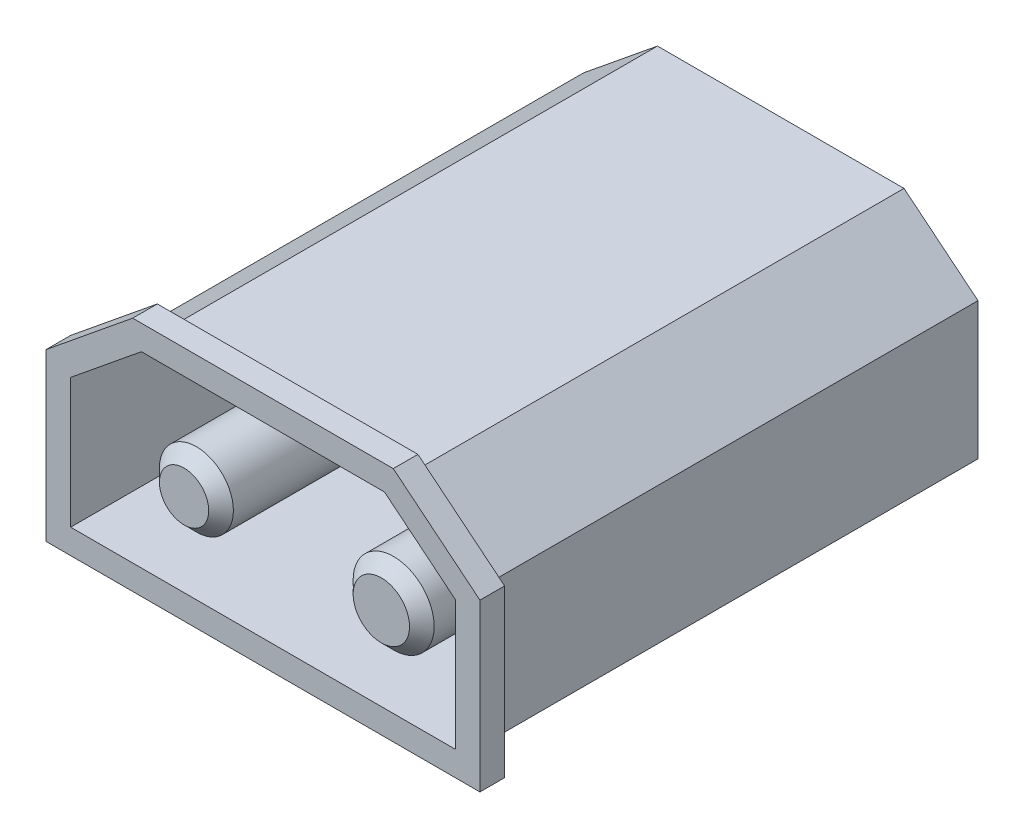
ISO-10303-21;
HEADER;
FILE_DESCRIPTION(('STEP AP214'),'2;1');
FILE_NAME('part.step','',(''),(''),'','','');
FILE_SCHEMA(('AUTOMOTIVE_DESIGN { 1 0 10303 214 1 1 1 1 }'));
ENDSEC;
DATA;
#1=APPLICATION_CONTEXT('core data for automotive mechanical design processes');
#2=APPLICATION_PROTOCOL_DEFINITION('international standard','automotive_design',2000,#1);
#3=PRODUCT_CONTEXT('',#1,'mechanical');
#4=PRODUCT('Part','Part','',(#3));
#5=PRODUCT_RELATED_PRODUCT_CATEGORY('part','',(#4));
#6=PRODUCT_DEFINITION_FORMATION('','',#4);
#7=PRODUCT_DEFINITION_CONTEXT('part definition',#1,'design');
#8=PRODUCT_DEFINITION('design','',#6,#7);
#9=PRODUCT_DEFINITION_SHAPE('','',#8);
#10=(LENGTH_UNIT() NAMED_UNIT(*) SI_UNIT(.MILLI.,.METRE.));
#11=(NAMED_UNIT(*) PLANE_ANGLE_UNIT() SI_UNIT($,.RADIAN.));
#12=(NAMED_UNIT(*) SI_UNIT($,.STERADIAN.) SOLID_ANGLE_UNIT());
#13=UNCERTAINTY_MEASURE_WITH_UNIT(LENGTH_MEASURE(1.E-05),#10,'distance_accuracy_value','');
#14=(GEOMETRIC_REPRESENTATION_CONTEXT(3) GLOBAL_UNCERTAINTY_ASSIGNED_CONTEXT((#13)) GLOBAL_UNIT_ASSIGNED_CONTEXT((#10,
#11,#12)) REPRESENTATION_CONTEXT('',''));
#15=CARTESIAN_POINT('',(0.,0.,0.));
#16=DIRECTION('',(0.,0.,1.));
#17=DIRECTION('',(1.,0.,0.));
#18=AXIS2_PLACEMENT_3D('',#15,#16,#17);
#19=CARTESIAN_POINT('',(-40.,-24.5,-19.8));
#20=DIRECTION('',(0.,0.,-1.));
#21=DIRECTION('',(-1.,0.,0.));
#22=AXIS2_PLACEMENT_3D('',#19,#20,#21);
#23=PLANE('',#22);
#24=CARTESIAN_POINT('',(-36.,-29.7213109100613,-19.8));
#25=DIRECTION('',(0.,0.,-1.));
#26=DIRECTION('',(-1.,0.,0.));
#27=AXIS2_PLACEMENT_3D('',#24,#25,#26);
#28=CIRCLE('',#27,1.5);
#29=CARTESIAN_POINT('',(-37.5,-29.7213109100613,-19.8));
#30=VERTEX_POINT('',#29);
#31=EDGE_CURVE('E313',#30,#30,#28,.F.);
#32=ORIENTED_EDGE('',*,*,#31,.F.);
#33=EDGE_LOOP('',(#32));
#34=FACE_BOUND('',#33,.T.);
#35=DIRECTION('',(0.,1.,0.));
#36=VECTOR('',#35,1.);
#37=CARTESIAN_POINT('',(-39.8,-32.5,-19.8));
#38=LINE('',#37,#36);
#39=CARTESIAN_POINT('',(-39.8,-32.3,-19.8));
#40=VERTEX_POINT('',#39);
#41=CARTESIAN_POINT('',(-39.8,-27.0376899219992,-19.8));
#42=VERTEX_POINT('',#41);
#43=EDGE_CURVE('E243',#40,#42,#38,.T.);
#44=ORIENTED_EDGE('',*,*,#43,.F.);
#45=DIRECTION('',(-1.,0.,0.));
#46=VECTOR('',#45,1.);
#47=CARTESIAN_POINT('',(-24.,-32.3,-19.8));
#48=LINE('',#47,#46);
#49=CARTESIAN_POINT('',(-24.2,-32.3,-19.8));
#50=VERTEX_POINT('',#49);
#51=EDGE_CURVE('E252',#50,#40,#48,.T.);
#52=ORIENTED_EDGE('',*,*,#51,.F.);
#53=DIRECTION('',(0.,-1.,0.));
#54=VECTOR('',#53,1.);
#55=CARTESIAN_POINT('',(-24.2,-26.9426218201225,-19.8));
#56=LINE('',#55,#54);
#57=CARTESIAN_POINT('',(-24.2,-27.0376899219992,-19.8));
#58=VERTEX_POINT('',#57);
#59=EDGE_CURVE('E166',#58,#50,#56,.T.);
#60=ORIENTED_EDGE('',*,*,#59,.F.);
#61=DIRECTION('',(0.77546564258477,-0.631389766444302,0.));
#62=VECTOR('',#61,1.);
#63=CARTESIAN_POINT('',(-27.1262779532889,-24.6550931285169,-19.8));
#64=LINE('',#63,#62);
#65=CARTESIAN_POINT('',(-27.0711238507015,-24.7,-19.8));
#66=VERTEX_POINT('',#65);
#67=EDGE_CURVE('E261',#66,#58,#64,.T.);
#68=ORIENTED_EDGE('',*,*,#67,.F.);
#69=DIRECTION('',(1.,0.,0.));
#70=VECTOR('',#69,1.);
#71=CARTESIAN_POINT('',(-37.,-24.7,-19.8));
#72=LINE('',#71,#70);
#73=CARTESIAN_POINT('',(-36.9288761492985,-24.7,-19.8));
#74=VERTEX_POINT('',#73);
#75=EDGE_CURVE('E257',#74,#66,#72,.T.);
#76=ORIENTED_EDGE('',*,*,#75,.F.);
#77=DIRECTION('',(0.775465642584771,0.631389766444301,0.));
#78=VECTOR('',#77,1.);
#79=CARTESIAN_POINT('',(-39.8737220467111,-27.0977149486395,-19.8));
#80=LINE('',#79,#78);
#81=EDGE_CURVE('E250',#42,#74,#80,.T.);
#82=ORIENTED_EDGE('',*,*,#81,.F.);
#83=EDGE_LOOP('',(#44,#52,#60,#68,#76,#82));
#84=FACE_BOUND('',#83,.T.);
#85=CARTESIAN_POINT('',(-28.,-29.7213109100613,-19.8));
#86=DIRECTION('',(0.,0.,-1.));
#87=DIRECTION('',(-1.,0.,0.));
#88=AXIS2_PLACEMENT_3D('',#85,#86,#87);
#89=CIRCLE('',#88,1.64304810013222);
#90=CARTESIAN_POINT('',(-29.6430481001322,-29.7213109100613,-19.8));
#91=VERTEX_POINT('',#90);
#92=EDGE_CURVE('E316',#91,#91,#89,.F.);
#93=ORIENTED_EDGE('',*,*,#92,.F.);
#94=EDGE_LOOP('',(#93));
#95=FACE_BOUND('',#94,.T.);
#96=ADVANCED_FACE('F30',(#34,#84,#95),#23,.F.);
#97=CARTESIAN_POINT('',(-39.8,-32.5,-20.));
#98=DIRECTION('',(1.,0.,0.));
#99=DIRECTION('',(0.,0.,-1.));
#100=AXIS2_PLACEMENT_3D('',#97,#98,#99);
#101=PLANE('',#100);
#102=DIRECTION('',(0.,0.,1.));
#103=VECTOR('',#102,1.);
#104=CARTESIAN_POINT('',(-39.8,-27.0376899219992,-20.));
#105=LINE('',#104,#103);
#106=CARTESIAN_POINT('',(-39.8,-27.0376899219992,1.));
#107=VERTEX_POINT('',#106);
#108=EDGE_CURVE('E244',#42,#107,#105,.T.);
#109=ORIENTED_EDGE('',*,*,#108,.T.);
#110=DIRECTION('',(0.,1.,0.));
#111=VECTOR('',#110,1.);
#112=CARTESIAN_POINT('',(-39.8,-32.3,1.));
#113=LINE('',#112,#111);
#114=CARTESIAN_POINT('',(-39.8,-32.3,1.));
#115=VERTEX_POINT('',#114);
#116=EDGE_CURVE('E179',#115,#107,#113,.T.);
#117=ORIENTED_EDGE('',*,*,#116,.F.);
#118=DIRECTION('',(0.,0.,1.));
#119=VECTOR('',#118,1.);
#120=CARTESIAN_POINT('',(-39.8,-32.3,-20.));
#121=LINE('',#120,#119);
#122=EDGE_CURVE('E171',#40,#115,#121,.T.);
#123=ORIENTED_EDGE('',*,*,#122,.F.);
#124=ORIENTED_EDGE('',*,*,#43,.T.);
#125=EDGE_LOOP('',(#109,#117,#123,#124));
#126=FACE_BOUND('',#125,.T.);
#127=ADVANCED_FACE('F348',(#126),#101,.T.);
#128=CARTESIAN_POINT('',(-39.8737220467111,-27.0977149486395,-20.));
#129=DIRECTION('',(0.631389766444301,-0.77546564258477,0.));
#130=DIRECTION('',(0.775465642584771,0.631389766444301,0.));
#131=AXIS2_PLACEMENT_3D('',#128,#129,#130);
#132=PLANE('',#131);
#133=DIRECTION('',(0.,0.,1.));
#134=VECTOR('',#133,1.);
#135=CARTESIAN_POINT('',(-36.9288761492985,-24.7,-20.));
#136=LINE('',#135,#134);
#137=CARTESIAN_POINT('',(-36.9288761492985,-24.7,1.));
#138=VERTEX_POINT('',#137);
#139=EDGE_CURVE('E247',#74,#138,#136,.T.);
#140=ORIENTED_EDGE('',*,*,#139,.T.);
#141=DIRECTION('',(0.77546564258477,0.631389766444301,0.));
#142=VECTOR('',#141,1.);
#143=CARTESIAN_POINT('',(-39.8,-27.0376899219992,1.));
#144=LINE('',#143,#142);
#145=EDGE_CURVE('E189',#107,#138,#144,.T.);
#146=ORIENTED_EDGE('',*,*,#145,.F.);
#147=ORIENTED_EDGE('',*,*,#108,.F.);
#148=ORIENTED_EDGE('',*,*,#81,.T.);
#149=EDGE_LOOP('',(#140,#146,#147,#148));
#150=FACE_BOUND('',#149,.T.);
#151=ADVANCED_FACE('F354',(#150),#132,.T.);
#152=CARTESIAN_POINT('',(-37.,-24.7,-20.));
#153=DIRECTION('',(0.,-1.,0.));
#154=DIRECTION('',(0.,0.,-1.));
#155=AXIS2_PLACEMENT_3D('',#152,#153,#154);
#156=PLANE('',#155);
#157=DIRECTION('',(0.,0.,1.));
#158=VECTOR('',#157,1.);
#159=CARTESIAN_POINT('',(-27.0711238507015,-24.7,-20.));
#160=LINE('',#159,#158);
#161=CARTESIAN_POINT('',(-27.0711238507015,-24.7,1.));
#162=VERTEX_POINT('',#161);
#163=EDGE_CURVE('E254',#66,#162,#160,.T.);
#164=ORIENTED_EDGE('',*,*,#163,.T.);
#165=DIRECTION('',(1.,0.,0.));
#166=VECTOR('',#165,1.);
#167=CARTESIAN_POINT('',(-36.9288761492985,-24.7,1.));
#168=LINE('',#167,#166);
#169=EDGE_CURVE('E192',#138,#162,#168,.T.);
#170=ORIENTED_EDGE('',*,*,#169,.F.);
#171=ORIENTED_EDGE('',*,*,#139,.F.);
#172=ORIENTED_EDGE('',*,*,#75,.T.);
#173=EDGE_LOOP('',(#164,#170,#171,#172));
#174=FACE_BOUND('',#173,.T.);
#175=ADVANCED_FACE('F527',(#174),#156,.T.);
#176=CARTESIAN_POINT('',(-27.1262779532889,-24.6550931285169,-20.));
#177=DIRECTION('',(-0.631389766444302,-0.77546564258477,0.));
#178=DIRECTION('',(0.77546564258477,-0.631389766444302,0.));
#179=AXIS2_PLACEMENT_3D('',#176,#177,#178);
#180=PLANE('',#179);
#181=DIRECTION('',(0.,0.,1.));
#182=VECTOR('',#181,1.);
#183=CARTESIAN_POINT('',(-24.2,-27.0376899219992,-20.));
#184=LINE('',#183,#182);
#185=CARTESIAN_POINT('',(-24.2,-27.0376899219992,1.));
#186=VERTEX_POINT('',#185);
#187=EDGE_CURVE('E170',#58,#186,#184,.T.);
#188=ORIENTED_EDGE('',*,*,#187,.T.);
#189=DIRECTION('',(0.775465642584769,-0.631389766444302,0.));
#190=VECTOR('',#189,1.);
#191=CARTESIAN_POINT('',(-27.0711238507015,-24.7,1.));
#192=LINE('',#191,#190);
#193=EDGE_CURVE('E185',#162,#186,#192,.T.);
#194=ORIENTED_EDGE('',*,*,#193,.F.);
#195=ORIENTED_EDGE('',*,*,#163,.F.);
#196=ORIENTED_EDGE('',*,*,#67,.T.);
#197=EDGE_LOOP('',(#188,#194,#195,#196));
#198=FACE_BOUND('',#197,.T.);
#199=ADVANCED_FACE('F518',(#198),#180,.T.);
#200=CARTESIAN_POINT('',(-24.2,-26.9426218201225,-20.));
#201=DIRECTION('',(-1.,0.,0.));
#202=DIRECTION('',(0.,0.,1.));
#203=AXIS2_PLACEMENT_3D('',#200,#201,#202);
#204=PLANE('',#203);
#205=DIRECTION('',(0.,0.,1.));
#206=VECTOR('',#205,1.);
#207=CARTESIAN_POINT('',(-24.2,-32.3,-20.));
#208=LINE('',#207,#206);
#209=CARTESIAN_POINT('',(-24.2,-32.3,1.));
#210=VERTEX_POINT('',#209);
#211=EDGE_CURVE('E159',#50,#210,#208,.T.);
#212=ORIENTED_EDGE('',*,*,#211,.T.);
#213=DIRECTION('',(0.,-1.,0.));
#214=VECTOR('',#213,1.);
#215=CARTESIAN_POINT('',(-24.2,-27.0376899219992,1.));
#216=LINE('',#215,#214);
#217=EDGE_CURVE('E163',#186,#210,#216,.T.);
#218=ORIENTED_EDGE('',*,*,#217,.F.);
#219=ORIENTED_EDGE('',*,*,#187,.F.);
#220=ORIENTED_EDGE('',*,*,#59,.T.);
#221=EDGE_LOOP('',(#212,#218,#219,#220));
#222=FACE_BOUND('',#221,.T.);
#223=ADVANCED_FACE('F161',(#222),#204,.T.);
#224=CARTESIAN_POINT('',(-24.,-32.3,-20.));
#225=DIRECTION('',(0.,1.,0.));
#226=DIRECTION('',(0.,0.,1.));
#227=AXIS2_PLACEMENT_3D('',#224,#225,#226);
#228=PLANE('',#227);
#229=ORIENTED_EDGE('',*,*,#51,.T.);
#230=ORIENTED_EDGE('',*,*,#122,.T.);
#231=DIRECTION('',(-1.,0.,0.));
#232=VECTOR('',#231,1.);
#233=CARTESIAN_POINT('',(-24.2,-32.3,1.));
#234=LINE('',#233,#232);
#235=EDGE_CURVE('E174',#210,#115,#234,.T.);
#236=ORIENTED_EDGE('',*,*,#235,.F.);
#237=ORIENTED_EDGE('',*,*,#211,.F.);
#238=EDGE_LOOP('',(#229,#230,#236,#237));
#239=FACE_BOUND('',#238,.T.);
#240=ADVANCED_FACE('F175',(#239),#228,.T.);
#241=CARTESIAN_POINT('',(-36.,-29.7213109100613,0.199999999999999));
#242=DIRECTION('',(0.,0.,-1.));
#243=DIRECTION('',(-1.,0.,0.));
#244=AXIS2_PLACEMENT_3D('',#241,#242,#243);
#245=CYLINDRICAL_SURFACE('',#244,1.5);
#246=CARTESIAN_POINT('',(-36.,-29.7213109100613,-0.300000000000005));
#247=DIRECTION('',(0.,0.,1.));
#248=DIRECTION('',(1.,0.,0.));
#249=AXIS2_PLACEMENT_3D('',#246,#247,#248);
#250=CIRCLE('',#249,1.5);
#251=CARTESIAN_POINT('',(-34.5,-29.7213109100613,-0.300000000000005));
#252=VERTEX_POINT('',#251);
#253=EDGE_CURVE('E322',#252,#252,#250,.F.);
#254=ORIENTED_EDGE('',*,*,#253,.T.);
#255=EDGE_LOOP('',(#254));
#256=FACE_BOUND('',#255,.T.);
#257=ORIENTED_EDGE('',*,*,#31,.T.);
#258=EDGE_LOOP('',(#257));
#259=FACE_BOUND('',#258,.T.);
#260=ADVANCED_FACE('F474',(#256,#259),#245,.T.);
#261=CARTESIAN_POINT('',(-36.,-29.7213109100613,0.199999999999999));
#262=DIRECTION('',(0.,0.,1.));
#263=DIRECTION('',(1.,0.,0.));
#264=AXIS2_PLACEMENT_3D('',#261,#262,#263);
#265=PLANE('',#264);
#266=CARTESIAN_POINT('',(-36.,-29.7213109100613,0.199999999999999));
#267=DIRECTION('',(0.,0.,1.));
#268=DIRECTION('',(1.,0.,0.));
#269=AXIS2_PLACEMENT_3D('',#266,#267,#268);
#270=CIRCLE('',#269,0.999999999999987);
#271=CARTESIAN_POINT('',(-35.,-29.7213109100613,0.199999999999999));
#272=VERTEX_POINT('',#271);
#273=EDGE_CURVE('E319',#272,#272,#270,.T.);
#274=ORIENTED_EDGE('',*,*,#273,.T.);
#275=EDGE_LOOP('',(#274));
#276=FACE_BOUND('',#275,.T.);
#277=ADVANCED_FACE('F482',(#276),#265,.T.);
#278=CARTESIAN_POINT('',(-28.,-29.7213109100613,0.199999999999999));
#279=DIRECTION('',(0.,0.,-1.));
#280=DIRECTION('',(-1.,0.,0.));
#281=AXIS2_PLACEMENT_3D('',#278,#279,#280);
#282=CYLINDRICAL_SURFACE('',#281,1.64304810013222);
#283=CARTESIAN_POINT('',(-28.,-29.7213109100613,-0.300000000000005));
#284=DIRECTION('',(0.,0.,1.));
#285=DIRECTION('',(1.,0.,0.));
#286=AXIS2_PLACEMENT_3D('',#283,#284,#285);
#287=CIRCLE('',#286,1.64304810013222);
#288=CARTESIAN_POINT('',(-26.3569518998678,-29.7213109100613,-0.300000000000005));
#289=VERTEX_POINT('',#288);
#290=EDGE_CURVE('E11',#289,#289,#287,.F.);
#291=ORIENTED_EDGE('',*,*,#290,.T.);
#292=EDGE_LOOP('',(#291));
#293=FACE_BOUND('',#292,.T.);
#294=ORIENTED_EDGE('',*,*,#92,.T.);
#295=EDGE_LOOP('',(#294));
#296=FACE_BOUND('',#295,.T.);
#297=ADVANCED_FACE('F344',(#293,#296),#282,.T.);
#298=CARTESIAN_POINT('',(-28.,-29.7213109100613,0.199999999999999));
#299=DIRECTION('',(0.,0.,1.));
#300=DIRECTION('',(1.,0.,0.));
#301=AXIS2_PLACEMENT_3D('',#298,#299,#300);
#302=PLANE('',#301);
#303=CARTESIAN_POINT('',(-28.,-29.7213109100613,0.199999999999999));
#304=DIRECTION('',(0.,0.,1.));
#305=DIRECTION('',(1.,0.,0.));
#306=AXIS2_PLACEMENT_3D('',#303,#304,#305);
#307=CIRCLE('',#306,1.14304810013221);
#308=CARTESIAN_POINT('',(-26.8569518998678,-29.7213109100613,0.199999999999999));
#309=VERTEX_POINT('',#308);
#310=EDGE_CURVE('E38',#309,#309,#307,.T.);
#311=ORIENTED_EDGE('',*,*,#310,.T.);
#312=EDGE_LOOP('',(#311));
#313=FACE_BOUND('',#312,.T.);
#314=ADVANCED_FACE('F327',(#313),#302,.T.);
#315=CARTESIAN_POINT('',(-36.,-29.7213109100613,0.199999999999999));
#316=DIRECTION('',(0.,0.,-1.));
#317=DIRECTION('',(-1.,0.,0.));
#318=AXIS2_PLACEMENT_3D('',#315,#316,#317);
#319=CONICAL_SURFACE('',#318,0.999999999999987,0.785398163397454);
#320=ORIENTED_EDGE('',*,*,#253,.F.);
#321=EDGE_LOOP('',(#320));
#322=FACE_BOUND('',#321,.T.);
#323=ORIENTED_EDGE('',*,*,#273,.F.);
#324=EDGE_LOOP('',(#323));
#325=FACE_BOUND('',#324,.T.);
#326=ADVANCED_FACE('F332',(#322,#325),#319,.T.);
#327=CARTESIAN_POINT('',(-28.,-29.7213109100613,0.199999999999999));
#328=DIRECTION('',(0.,0.,-1.));
#329=DIRECTION('',(-1.,0.,0.));
#330=AXIS2_PLACEMENT_3D('',#327,#328,#329);
#331=CONICAL_SURFACE('',#330,1.14304810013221,0.785398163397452);
#332=ORIENTED_EDGE('',*,*,#290,.F.);
#333=EDGE_LOOP('',(#332));
#334=FACE_BOUND('',#333,.T.);
#335=ORIENTED_EDGE('',*,*,#310,.F.);
#336=EDGE_LOOP('',(#335));
#337=FACE_BOUND('',#336,.T.);
#338=ADVANCED_FACE('F329',(#334,#337),#331,.T.);
#339=CARTESIAN_POINT('',(-23.2,-33.3,0.));
#340=DIRECTION('',(0.,0.,-1.));
#341=DIRECTION('',(-1.,0.,0.));
#342=AXIS2_PLACEMENT_3D('',#339,#340,#341);
#343=PLANE('',#342);
#344=DIRECTION('',(0.,-1.,0.));
#345=VECTOR('',#344,1.);
#346=CARTESIAN_POINT('',(-23.2,-26.5623494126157,0.));
#347=LINE('',#346,#345);
#348=CARTESIAN_POINT('',(-23.2,-26.5623494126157,0.));
#349=VERTEX_POINT('',#348);
#350=CARTESIAN_POINT('',(-23.2,-33.3,0.));
#351=VERTEX_POINT('',#350);
#352=EDGE_CURVE('E195',#349,#351,#347,.T.);
#353=ORIENTED_EDGE('',*,*,#352,.T.);
#354=DIRECTION('',(-1.,0.,0.));
#355=VECTOR('',#354,1.);
#356=CARTESIAN_POINT('',(-23.2,-33.3,0.));
#357=LINE('',#356,#355);
#358=CARTESIAN_POINT('',(-40.8,-33.3,0.));
#359=VERTEX_POINT('',#358);
#360=EDGE_CURVE('E198',#351,#359,#357,.T.);
#361=ORIENTED_EDGE('',*,*,#360,.T.);
#362=DIRECTION('',(0.,1.,0.));
#363=VECTOR('',#362,1.);
#364=CARTESIAN_POINT('',(-40.8,-33.3,0.));
#365=LINE('',#364,#363);
#366=CARTESIAN_POINT('',(-40.8,-26.5623494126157,0.));
#367=VERTEX_POINT('',#366);
#368=EDGE_CURVE('E201',#359,#367,#365,.T.);
#369=ORIENTED_EDGE('',*,*,#368,.T.);
#370=DIRECTION('',(0.77546564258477,0.631389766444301,0.));
#371=VECTOR('',#370,1.);
#372=CARTESIAN_POINT('',(-40.8,-26.5623494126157,0.));
#373=LINE('',#372,#371);
#374=CARTESIAN_POINT('',(-37.284495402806,-23.7,0.));
#375=VERTEX_POINT('',#374);
#376=EDGE_CURVE('E204',#367,#375,#373,.T.);
#377=ORIENTED_EDGE('',*,*,#376,.T.);
#378=DIRECTION('',(1.,0.,0.));
#379=VECTOR('',#378,1.);
#380=CARTESIAN_POINT('',(-37.284495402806,-23.7,0.));
#381=LINE('',#380,#379);
#382=CARTESIAN_POINT('',(-26.715504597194,-23.7,0.));
#383=VERTEX_POINT('',#382);
#384=EDGE_CURVE('E207',#375,#383,#381,.T.);
#385=ORIENTED_EDGE('',*,*,#384,.T.);
#386=DIRECTION('',(0.775465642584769,-0.631389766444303,0.));
#387=VECTOR('',#386,1.);
#388=CARTESIAN_POINT('',(-26.715504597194,-23.7,0.));
#389=LINE('',#388,#387);
#390=EDGE_CURVE('E210',#383,#349,#389,.T.);
#391=ORIENTED_EDGE('',*,*,#390,.T.);
#392=EDGE_LOOP('',(#353,#361,#369,#377,#385,#391));
#393=FACE_BOUND('',#392,.T.);
#394=DIRECTION('',(0.,1.,0.));
#395=VECTOR('',#394,1.);
#396=CARTESIAN_POINT('',(-40.,-32.5,0.));
#397=LINE('',#396,#395);
#398=CARTESIAN_POINT('',(-40.,-32.5,0.));
#399=VERTEX_POINT('',#398);
#400=CARTESIAN_POINT('',(-40.,-26.9426218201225,0.));
#401=VERTEX_POINT('',#400);
#402=EDGE_CURVE('E246',#399,#401,#397,.T.);
#403=ORIENTED_EDGE('',*,*,#402,.F.);
#404=DIRECTION('',(-1.,0.,0.));
#405=VECTOR('',#404,1.);
#406=CARTESIAN_POINT('',(-24.,-32.5,0.));
#407=LINE('',#406,#405);
#408=CARTESIAN_POINT('',(-24.,-32.5,0.));
#409=VERTEX_POINT('',#408);
#410=EDGE_CURVE('E280',#409,#399,#407,.T.);
#411=ORIENTED_EDGE('',*,*,#410,.F.);
#412=DIRECTION('',(0.,-1.,0.));
#413=VECTOR('',#412,1.);
#414=CARTESIAN_POINT('',(-24.,-26.9426218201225,0.));
#415=LINE('',#414,#413);
#416=CARTESIAN_POINT('',(-24.,-26.9426218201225,0.));
#417=VERTEX_POINT('',#416);
#418=EDGE_CURVE('E278',#417,#409,#415,.T.);
#419=ORIENTED_EDGE('',*,*,#418,.F.);
#420=DIRECTION('',(0.77546564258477,-0.631389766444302,0.));
#421=VECTOR('',#420,1.);
#422=CARTESIAN_POINT('',(-27.,-24.5,0.));
#423=LINE('',#422,#421);
#424=CARTESIAN_POINT('',(-27.,-24.5,0.));
#425=VERTEX_POINT('',#424);
#426=EDGE_CURVE('E275',#425,#417,#423,.T.);
#427=ORIENTED_EDGE('',*,*,#426,.F.);
#428=DIRECTION('',(1.,0.,0.));
#429=VECTOR('',#428,1.);
#430=CARTESIAN_POINT('',(-37.,-24.5,0.));
#431=LINE('',#430,#429);
#432=CARTESIAN_POINT('',(-37.,-24.5,0.));
#433=VERTEX_POINT('',#432);
#434=EDGE_CURVE('E272',#433,#425,#431,.T.);
#435=ORIENTED_EDGE('',*,*,#434,.F.);
#436=DIRECTION('',(0.77546564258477,0.631389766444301,0.));
#437=VECTOR('',#436,1.);
#438=CARTESIAN_POINT('',(-40.,-26.9426218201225,0.));
#439=LINE('',#438,#437);
#440=EDGE_CURVE('E269',#401,#433,#439,.T.);
#441=ORIENTED_EDGE('',*,*,#440,.F.);
#442=EDGE_LOOP('',(#403,#411,#419,#427,#435,#441));
#443=FACE_BOUND('',#442,.T.);
#444=ADVANCED_FACE('F331',(#393,#443),#343,.T.);
#445=CARTESIAN_POINT('',(-23.2,-26.5623494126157,1.));
#446=DIRECTION('',(1.,0.,0.));
#447=DIRECTION('',(0.,0.,-1.));
#448=AXIS2_PLACEMENT_3D('',#445,#446,#447);
#449=PLANE('',#448);
#450=DIRECTION('',(0.,0.,-1.));
#451=VECTOR('',#450,1.);
#452=CARTESIAN_POINT('',(-23.2,-26.5623494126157,1.));
#453=LINE('',#452,#451);
#454=CARTESIAN_POINT('',(-23.2,-26.5623494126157,1.));
#455=VERTEX_POINT('',#454);
#456=EDGE_CURVE('E241',#455,#349,#453,.T.);
#457=ORIENTED_EDGE('',*,*,#456,.F.);
#458=DIRECTION('',(0.,-1.,0.));
#459=VECTOR('',#458,1.);
#460=CARTESIAN_POINT('',(-23.2,-26.5623494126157,1.));
#461=LINE('',#460,#459);
#462=CARTESIAN_POINT('',(-23.2,-33.3,1.));
#463=VERTEX_POINT('',#462);
#464=EDGE_CURVE('E213',#455,#463,#461,.T.);
#465=ORIENTED_EDGE('',*,*,#464,.T.);
#466=DIRECTION('',(0.,0.,-1.));
#467=VECTOR('',#466,1.);
#468=CARTESIAN_POINT('',(-23.2,-33.3,1.));
#469=LINE('',#468,#467);
#470=EDGE_CURVE('E231',#463,#351,#469,.T.);
#471=ORIENTED_EDGE('',*,*,#470,.T.);
#472=ORIENTED_EDGE('',*,*,#352,.F.);
#473=EDGE_LOOP('',(#457,#465,#471,#472));
#474=FACE_BOUND('',#473,.T.);
#475=ADVANCED_FACE('F339',(#474),#449,.T.);
#476=CARTESIAN_POINT('',(-26.715504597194,-23.7,1.));
#477=DIRECTION('',(0.631389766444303,0.775465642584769,0.));
#478=DIRECTION('',(-0.775465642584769,0.631389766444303,0.));
#479=AXIS2_PLACEMENT_3D('',#476,#477,#478);
#480=PLANE('',#479);
#481=DIRECTION('',(0.,0.,-1.));
#482=VECTOR('',#481,1.);
#483=CARTESIAN_POINT('',(-26.715504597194,-23.7,1.));
#484=LINE('',#483,#482);
#485=CARTESIAN_POINT('',(-26.715504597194,-23.7,1.));
#486=VERTEX_POINT('',#485);
#487=EDGE_CURVE('E239',#486,#383,#484,.T.);
#488=ORIENTED_EDGE('',*,*,#487,.F.);
#489=DIRECTION('',(0.775465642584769,-0.631389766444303,0.));
#490=VECTOR('',#489,1.);
#491=CARTESIAN_POINT('',(-26.715504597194,-23.7,1.));
#492=LINE('',#491,#490);
#493=EDGE_CURVE('E228',#486,#455,#492,.T.);
#494=ORIENTED_EDGE('',*,*,#493,.T.);
#495=ORIENTED_EDGE('',*,*,#456,.T.);
#496=ORIENTED_EDGE('',*,*,#390,.F.);
#497=EDGE_LOOP('',(#488,#494,#495,#496));
#498=FACE_BOUND('',#497,.T.);
#499=ADVANCED_FACE('F433',(#498),#480,.T.);
#500=CARTESIAN_POINT('',(-37.284495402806,-23.7,1.));
#501=DIRECTION('',(0.,1.,0.));
#502=DIRECTION('',(0.,0.,1.));
#503=AXIS2_PLACEMENT_3D('',#500,#501,#502);
#504=PLANE('',#503);
#505=DIRECTION('',(0.,0.,-1.));
#506=VECTOR('',#505,1.);
#507=CARTESIAN_POINT('',(-37.284495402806,-23.7,1.));
#508=LINE('',#507,#506);
#509=CARTESIAN_POINT('',(-37.284495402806,-23.7,1.));
#510=VERTEX_POINT('',#509);
#511=EDGE_CURVE('E237',#510,#375,#508,.T.);
#512=ORIENTED_EDGE('',*,*,#511,.F.);
#513=DIRECTION('',(1.,0.,0.));
#514=VECTOR('',#513,1.);
#515=CARTESIAN_POINT('',(-37.284495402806,-23.7,1.));
#516=LINE('',#515,#514);
#517=EDGE_CURVE('E225',#510,#486,#516,.T.);
#518=ORIENTED_EDGE('',*,*,#517,.T.);
#519=ORIENTED_EDGE('',*,*,#487,.T.);
#520=ORIENTED_EDGE('',*,*,#384,.F.);
#521=EDGE_LOOP('',(#512,#518,#519,#520));
#522=FACE_BOUND('',#521,.T.);
#523=ADVANCED_FACE('F425',(#522),#504,.T.);
#524=CARTESIAN_POINT('',(-40.8,-26.5623494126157,1.));
#525=DIRECTION('',(-0.631389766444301,0.77546564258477,0.));
#526=DIRECTION('',(-0.77546564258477,-0.631389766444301,0.));
#527=AXIS2_PLACEMENT_3D('',#524,#525,#526);
#528=PLANE('',#527);
#529=DIRECTION('',(0.,0.,-1.));
#530=VECTOR('',#529,1.);
#531=CARTESIAN_POINT('',(-40.8,-26.5623494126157,1.));
#532=LINE('',#531,#530);
#533=CARTESIAN_POINT('',(-40.8,-26.5623494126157,1.));
#534=VERTEX_POINT('',#533);
#535=EDGE_CURVE('E235',#534,#367,#532,.T.);
#536=ORIENTED_EDGE('',*,*,#535,.F.);
#537=DIRECTION('',(0.77546564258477,0.631389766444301,0.));
#538=VECTOR('',#537,1.);
#539=CARTESIAN_POINT('',(-40.8,-26.5623494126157,1.));
#540=LINE('',#539,#538);
#541=EDGE_CURVE('E222',#534,#510,#540,.T.);
#542=ORIENTED_EDGE('',*,*,#541,.T.);
#543=ORIENTED_EDGE('',*,*,#511,.T.);
#544=ORIENTED_EDGE('',*,*,#376,.F.);
#545=EDGE_LOOP('',(#536,#542,#543,#544));
#546=FACE_BOUND('',#545,.T.);
#547=ADVANCED_FACE('F417',(#546),#528,.T.);
#548=CARTESIAN_POINT('',(-40.8,-33.3,1.));
#549=DIRECTION('',(-1.,0.,0.));
#550=DIRECTION('',(0.,0.,1.));
#551=AXIS2_PLACEMENT_3D('',#548,#549,#550);
#552=PLANE('',#551);
#553=DIRECTION('',(0.,0.,-1.));
#554=VECTOR('',#553,1.);
#555=CARTESIAN_POINT('',(-40.8,-33.3,1.));
#556=LINE('',#555,#554);
#557=CARTESIAN_POINT('',(-40.8,-33.3,1.));
#558=VERTEX_POINT('',#557);
#559=EDGE_CURVE('E233',#558,#359,#556,.T.);
#560=ORIENTED_EDGE('',*,*,#559,.F.);
#561=DIRECTION('',(0.,1.,0.));
#562=VECTOR('',#561,1.);
#563=CARTESIAN_POINT('',(-40.8,-33.3,1.));
#564=LINE('',#563,#562);
#565=EDGE_CURVE('E219',#558,#534,#564,.T.);
#566=ORIENTED_EDGE('',*,*,#565,.T.);
#567=ORIENTED_EDGE('',*,*,#535,.T.);
#568=ORIENTED_EDGE('',*,*,#368,.F.);
#569=EDGE_LOOP('',(#560,#566,#567,#568));
#570=FACE_BOUND('',#569,.T.);
#571=ADVANCED_FACE('F404',(#570),#552,.T.);
#572=CARTESIAN_POINT('',(-23.2,-33.3,1.));
#573=DIRECTION('',(0.,-1.,0.));
#574=DIRECTION('',(0.,0.,-1.));
#575=AXIS2_PLACEMENT_3D('',#572,#573,#574);
#576=PLANE('',#575);
#577=DIRECTION('',(-1.,0.,0.));
#578=VECTOR('',#577,1.);
#579=CARTESIAN_POINT('',(-23.2,-33.3,1.));
#580=LINE('',#579,#578);
#581=EDGE_CURVE('E216',#463,#558,#580,.T.);
#582=ORIENTED_EDGE('',*,*,#581,.T.);
#583=ORIENTED_EDGE('',*,*,#559,.T.);
#584=ORIENTED_EDGE('',*,*,#360,.F.);
#585=ORIENTED_EDGE('',*,*,#470,.F.);
#586=EDGE_LOOP('',(#582,#583,#584,#585));
#587=FACE_BOUND('',#586,.T.);
#588=ADVANCED_FACE('F366',(#587),#576,.T.);
#589=CARTESIAN_POINT('',(-23.2,-33.3,1.));
#590=DIRECTION('',(0.,0.,-1.));
#591=DIRECTION('',(-1.,0.,0.));
#592=AXIS2_PLACEMENT_3D('',#589,#590,#591);
#593=PLANE('',#592);
#594=ORIENTED_EDGE('',*,*,#193,.T.);
#595=ORIENTED_EDGE('',*,*,#217,.T.);
#596=ORIENTED_EDGE('',*,*,#235,.T.);
#597=ORIENTED_EDGE('',*,*,#116,.T.);
#598=ORIENTED_EDGE('',*,*,#145,.T.);
#599=ORIENTED_EDGE('',*,*,#169,.T.);
#600=EDGE_LOOP('',(#594,#595,#596,#597,#598,#599));
#601=FACE_BOUND('',#600,.T.);
#602=ORIENTED_EDGE('',*,*,#464,.F.);
#603=ORIENTED_EDGE('',*,*,#493,.F.);
#604=ORIENTED_EDGE('',*,*,#517,.F.);
#605=ORIENTED_EDGE('',*,*,#541,.F.);
#606=ORIENTED_EDGE('',*,*,#565,.F.);
#607=ORIENTED_EDGE('',*,*,#581,.F.);
#608=EDGE_LOOP('',(#602,#603,#604,#605,#606,#607));
#609=FACE_BOUND('',#608,.T.);
#610=ADVANCED_FACE('F181',(#601,#609),#593,.F.);
#611=CARTESIAN_POINT('',(-40.,-24.5,-20.));
#612=DIRECTION('',(0.,0.,-1.));
#613=DIRECTION('',(-1.,0.,0.));
#614=AXIS2_PLACEMENT_3D('',#611,#612,#613);
#615=PLANE('',#614);
#616=DIRECTION('',(0.,1.,0.));
#617=VECTOR('',#616,1.);
#618=CARTESIAN_POINT('',(-40.,-32.5,-20.));
#619=LINE('',#618,#617);
#620=CARTESIAN_POINT('',(-40.,-32.5,-20.));
#621=VERTEX_POINT('',#620);
#622=CARTESIAN_POINT('',(-40.,-26.9426218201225,-20.));
#623=VERTEX_POINT('',#622);
#624=EDGE_CURVE('E282',#621,#623,#619,.T.);
#625=ORIENTED_EDGE('',*,*,#624,.T.);
#626=DIRECTION('',(0.77546564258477,0.631389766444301,0.));
#627=VECTOR('',#626,1.);
#628=CARTESIAN_POINT('',(-40.,-26.9426218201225,-20.));
#629=LINE('',#628,#627);
#630=CARTESIAN_POINT('',(-37.,-24.5,-20.));
#631=VERTEX_POINT('',#630);
#632=EDGE_CURVE('E285',#623,#631,#629,.T.);
#633=ORIENTED_EDGE('',*,*,#632,.T.);
#634=DIRECTION('',(1.,0.,0.));
#635=VECTOR('',#634,1.);
#636=CARTESIAN_POINT('',(-37.,-24.5,-20.));
#637=LINE('',#636,#635);
#638=CARTESIAN_POINT('',(-27.,-24.5,-20.));
#639=VERTEX_POINT('',#638);
#640=EDGE_CURVE('E288',#631,#639,#637,.T.);
#641=ORIENTED_EDGE('',*,*,#640,.T.);
#642=DIRECTION('',(0.77546564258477,-0.631389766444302,0.));
#643=VECTOR('',#642,1.);
#644=CARTESIAN_POINT('',(-27.,-24.5,-20.));
#645=LINE('',#644,#643);
#646=CARTESIAN_POINT('',(-24.,-26.9426218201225,-20.));
#647=VERTEX_POINT('',#646);
#648=EDGE_CURVE('E291',#639,#647,#645,.T.);
#649=ORIENTED_EDGE('',*,*,#648,.T.);
#650=DIRECTION('',(0.,-1.,0.));
#651=VECTOR('',#650,1.);
#652=CARTESIAN_POINT('',(-24.,-26.9426218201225,-20.));
#653=LINE('',#652,#651);
#654=CARTESIAN_POINT('',(-24.,-32.5,-20.));
#655=VERTEX_POINT('',#654);
#656=EDGE_CURVE('E294',#647,#655,#653,.T.);
#657=ORIENTED_EDGE('',*,*,#656,.T.);
#658=DIRECTION('',(-1.,0.,0.));
#659=VECTOR('',#658,1.);
#660=CARTESIAN_POINT('',(-24.,-32.5,-20.));
#661=LINE('',#660,#659);
#662=EDGE_CURVE('E296',#655,#621,#661,.T.);
#663=ORIENTED_EDGE('',*,*,#662,.T.);
#664=EDGE_LOOP('',(#625,#633,#641,#649,#657,#663));
#665=FACE_BOUND('',#664,.T.);
#666=ADVANCED_FACE('F362',(#665),#615,.T.);
#667=CARTESIAN_POINT('',(-40.,-26.9426218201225,-20.));
#668=DIRECTION('',(0.631389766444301,-0.77546564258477,0.));
#669=DIRECTION('',(0.775465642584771,0.631389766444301,0.));
#670=AXIS2_PLACEMENT_3D('',#667,#668,#669);
#671=PLANE('',#670);
#672=DIRECTION('',(0.,0.,1.));
#673=VECTOR('',#672,1.);
#674=CARTESIAN_POINT('',(-37.,-24.5,-20.));
#675=LINE('',#674,#673);
#676=EDGE_CURVE('E307',#631,#433,#675,.T.);
#677=ORIENTED_EDGE('',*,*,#676,.F.);
#678=ORIENTED_EDGE('',*,*,#632,.F.);
#679=DIRECTION('',(0.,0.,1.));
#680=VECTOR('',#679,1.);
#681=CARTESIAN_POINT('',(-40.,-26.9426218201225,-20.));
#682=LINE('',#681,#680);
#683=EDGE_CURVE('E310',#623,#401,#682,.T.);
#684=ORIENTED_EDGE('',*,*,#683,.T.);
#685=ORIENTED_EDGE('',*,*,#440,.T.);
#686=EDGE_LOOP('',(#677,#678,#684,#685));
#687=FACE_BOUND('',#686,.T.);
#688=ADVANCED_FACE('F32',(#687),#671,.F.);
#689=CARTESIAN_POINT('',(-37.,-24.5,-20.));
#690=DIRECTION('',(0.,-1.,0.));
#691=DIRECTION('',(0.,0.,-1.));
#692=AXIS2_PLACEMENT_3D('',#689,#690,#691);
#693=PLANE('',#692);
#694=DIRECTION('',(0.,0.,1.));
#695=VECTOR('',#694,1.);
#696=CARTESIAN_POINT('',(-27.,-24.5,-20.));
#697=LINE('',#696,#695);
#698=EDGE_CURVE('E304',#639,#425,#697,.T.);
#699=ORIENTED_EDGE('',*,*,#698,.F.);
#700=ORIENTED_EDGE('',*,*,#640,.F.);
#701=ORIENTED_EDGE('',*,*,#676,.T.);
#702=ORIENTED_EDGE('',*,*,#434,.T.);
#703=EDGE_LOOP('',(#699,#700,#701,#702));
#704=FACE_BOUND('',#703,.T.);
#705=ADVANCED_FACE('F379',(#704),#693,.F.);
#706=CARTESIAN_POINT('',(-27.,-24.5,-20.));
#707=DIRECTION('',(-0.631389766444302,-0.77546564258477,0.));
#708=DIRECTION('',(0.77546564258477,-0.631389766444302,0.));
#709=AXIS2_PLACEMENT_3D('',#706,#707,#708);
#710=PLANE('',#709);
#711=DIRECTION('',(0.,0.,1.));
#712=VECTOR('',#711,1.);
#713=CARTESIAN_POINT('',(-24.,-26.9426218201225,-20.));
#714=LINE('',#713,#712);
#715=EDGE_CURVE('E301',#647,#417,#714,.T.);
#716=ORIENTED_EDGE('',*,*,#715,.F.);
#717=ORIENTED_EDGE('',*,*,#648,.F.);
#718=ORIENTED_EDGE('',*,*,#698,.T.);
#719=ORIENTED_EDGE('',*,*,#426,.T.);
#720=EDGE_LOOP('',(#716,#717,#718,#719));
#721=FACE_BOUND('',#720,.T.);
#722=ADVANCED_FACE('F377',(#721),#710,.F.);
#723=CARTESIAN_POINT('',(-24.,-26.9426218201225,-20.));
#724=DIRECTION('',(-1.,0.,0.));
#725=DIRECTION('',(0.,0.,1.));
#726=AXIS2_PLACEMENT_3D('',#723,#724,#725);
#727=PLANE('',#726);
#728=DIRECTION('',(0.,0.,1.));
#729=VECTOR('',#728,1.);
#730=CARTESIAN_POINT('',(-24.,-32.5,-20.));
#731=LINE('',#730,#729);
#732=EDGE_CURVE('E53',#655,#409,#731,.T.);
#733=ORIENTED_EDGE('',*,*,#732,.F.);
#734=ORIENTED_EDGE('',*,*,#656,.F.);
#735=ORIENTED_EDGE('',*,*,#715,.T.);
#736=ORIENTED_EDGE('',*,*,#418,.T.);
#737=EDGE_LOOP('',(#733,#734,#735,#736));
#738=FACE_BOUND('',#737,.T.);
#739=ADVANCED_FACE('F374',(#738),#727,.F.);
#740=CARTESIAN_POINT('',(-24.,-32.5,-20.));
#741=DIRECTION('',(0.,1.,0.));
#742=DIRECTION('',(0.,0.,1.));
#743=AXIS2_PLACEMENT_3D('',#740,#741,#742);
#744=PLANE('',#743);
#745=ORIENTED_EDGE('',*,*,#662,.F.);
#746=ORIENTED_EDGE('',*,*,#732,.T.);
#747=ORIENTED_EDGE('',*,*,#410,.T.);
#748=DIRECTION('',(0.,0.,1.));
#749=VECTOR('',#748,1.);
#750=CARTESIAN_POINT('',(-40.,-32.5,-20.));
#751=LINE('',#750,#749);
#752=EDGE_CURVE('E45',#621,#399,#751,.T.);
#753=ORIENTED_EDGE('',*,*,#752,.F.);
#754=EDGE_LOOP('',(#745,#746,#747,#753));
#755=FACE_BOUND('',#754,.T.);
#756=ADVANCED_FACE('F370',(#755),#744,.F.);
#757=CARTESIAN_POINT('',(-40.,-32.5,-20.));
#758=DIRECTION('',(1.,0.,0.));
#759=DIRECTION('',(0.,0.,-1.));
#760=AXIS2_PLACEMENT_3D('',#757,#758,#759);
#761=PLANE('',#760);
#762=ORIENTED_EDGE('',*,*,#683,.F.);
#763=ORIENTED_EDGE('',*,*,#624,.F.);
#764=ORIENTED_EDGE('',*,*,#752,.T.);
#765=ORIENTED_EDGE('',*,*,#402,.T.);
#766=EDGE_LOOP('',(#762,#763,#764,#765));
#767=FACE_BOUND('',#766,.T.);
#768=ADVANCED_FACE('F367',(#767),#761,.F.);
#769=CLOSED_SHELL('',(#96,#127,#151,#175,#199,#223,#240,#260,#277,#297,#314,#326,#338,#444,#475,
#499,#523,#547,#571,#588,#610,#666,#688,#705,#722,#739,#756,#768));
#770=MANIFOLD_SOLID_BREP('B2',#769);
#771=ADVANCED_BREP_SHAPE_REPRESENTATION('',(#18,#770),#14);
#772=SHAPE_DEFINITION_REPRESENTATION(#9,#771);
ENDSEC;
END-ISO-10303-21;
